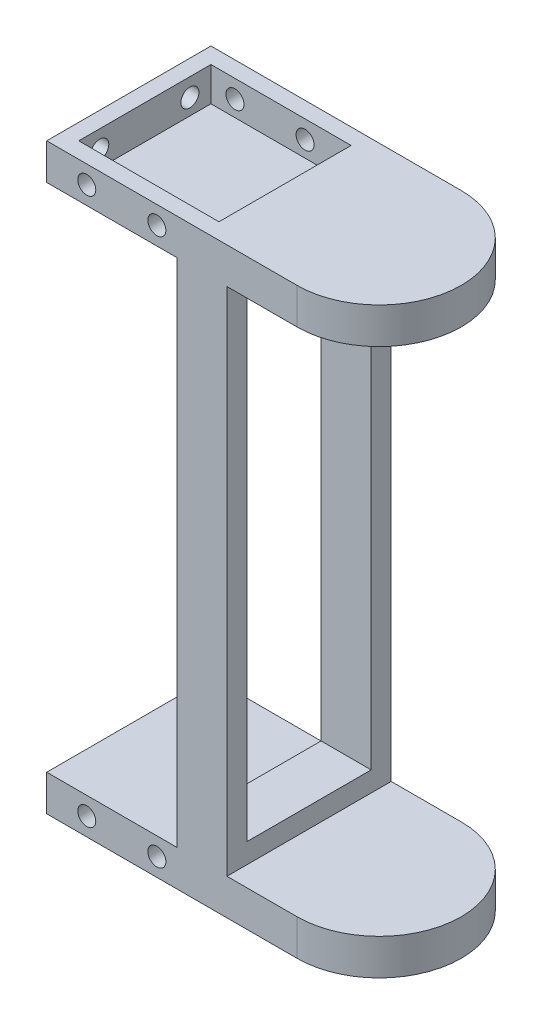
from build123d import *

# Parameters (mm, degrees)
LINEAR_AUSTRAGEN1_DEPTH         = 145.5
SKIZZE2_W                       = 76
SKIZZE2_H                       = 255
SKIZZE2_W_2                     = 65
SCHNITT_LINEAR_AUSTRAGEN1_DEPTH = 196.960455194
SKIZZE3_W                       = 70
SKIZZE3_H                       = 66
SCHNITT_LINEAR_AUSTRAGEN2_DEPTH = 17
SKIZZE4_R                       = 4.5
SCHNITT_LINEAR_AUSTRAGEN3_DEPTH = 196.960455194
SCHNITT_LINEAR_AUSTRAGEN4_REACH = 226.516
SKIZZE5_R                       = 4.5
SKIZZE6_W                       = 62
SKIZZE6_H                       = 235
SCHNITT_LINEAR_AUSTRAGEN5_DEPTH = 182.802777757


with BuildPart() as part:
    # Skizze1 → Linear austragen1 (new, symmetric)
    with BuildSketch(Plane(origin=(0, 0, 0), x_dir=(1, 0, 0), z_dir=(0, 1, 0))):
        with BuildLine():
            Line((-63.5, 41), (61.5, 41))
            ThreePointArc((61.5, 41), (102.5, 0), (61.5, -41))
            Line((61.5, -41), (-63.5, -41))
            Line((-63.5, -41), (-63.5, 41))
        make_face()
    extrude(amount=LINEAR_AUSTRAGEN1_DEPTH, both=True)

    # Skizze2 → Schnitt-Linear austragen1 (cut, through all)
    with BuildSketch(Plane.XY.offset(41)):
        with Locations((64.5, 0)):
            Rectangle(SKIZZE2_W, SKIZZE2_H)
        with Locations((-31, 0)):
            Rectangle(SKIZZE2_W_2, SKIZZE2_H)
    extrude(amount=-SCHNITT_LINEAR_AUSTRAGEN1_DEPTH, mode=Mode.SUBTRACT)

    # Skizze3 → Schnitt-Linear austragen2 (cut)
    with BuildSketch(Plane.XZ.offset(145.5)):
        with Locations((-20.5, 0)):
            Rectangle(SKIZZE3_W, SKIZZE3_H)
    schnitt_linear_austragen2 = extrude(amount=-SCHNITT_LINEAR_AUSTRAGEN2_DEPTH, mode=Mode.SUBTRACT)

    # Spiegeln1: Schnitt-Linear austragen2 across plane
    add(schnitt_linear_austragen2.mirror(Plane.ZX), mode=Mode.SUBTRACT)

    # Skizze4 → Schnitt-Linear austragen3 (cut, through all)
    with BuildSketch(Plane.XY.offset(41)):
        with Locations((-43.5, 136.5)):
            Circle(SKIZZE4_R)
        with Locations((-8.5, 136.5)):
            Circle(SKIZZE4_R)
        with Locations(Location((-8.5, -136.5, 0), (0, 0, 180))):
            Circle(SKIZZE4_R)
        with Locations(Location((-43.5, -136.5, 0), (0, 0, 180))):
            Circle(SKIZZE4_R)
    extrude(amount=-SCHNITT_LINEAR_AUSTRAGEN3_DEPTH, mode=Mode.SUBTRACT)

    # Skizze5 → Schnitt-Linear austragen4 (cut, up to next)
    with BuildSketch(Plane.ZY.offset(63.5), mode=Mode.PRIVATE) as schnitt_linear_austragen4_sk1:
        with Locations((-22.5, 136.5)):
            Circle(SKIZZE5_R)
    schnitt_linear_austragen4_tool1 = extrude(schnitt_linear_austragen4_sk1.sketch, amount=-SCHNITT_LINEAR_AUSTRAGEN4_REACH, mode=Mode.PRIVATE) & part.part
    # Skizze5 → Schnitt-Linear austragen4 (cut, up to next)
    with BuildSketch(Plane.ZY.offset(63.5), mode=Mode.PRIVATE) as schnitt_linear_austragen4_sk2:
        with Locations((22.5, 136.5)):
            Circle(SKIZZE5_R)
    schnitt_linear_austragen4_tool2 = extrude(schnitt_linear_austragen4_sk2.sketch, amount=-SCHNITT_LINEAR_AUSTRAGEN4_REACH, mode=Mode.PRIVATE) & part.part
    # Skizze5 → Schnitt-Linear austragen4 (cut, up to next)
    with BuildSketch(Plane.ZY.offset(63.5), mode=Mode.PRIVATE) as schnitt_linear_austragen4_sk3:
        with Locations((22.5, -136.5)):
            Circle(SKIZZE5_R)
    schnitt_linear_austragen4_tool3 = extrude(schnitt_linear_austragen4_sk3.sketch, amount=-SCHNITT_LINEAR_AUSTRAGEN4_REACH, mode=Mode.PRIVATE) & part.part
    # Skizze5 → Schnitt-Linear austragen4 (cut, up to next)
    with BuildSketch(Plane.ZY.offset(63.5), mode=Mode.PRIVATE) as schnitt_linear_austragen4_sk4:
        with Locations((-22.5, -136.5)):
            Circle(SKIZZE5_R)
    schnitt_linear_austragen4_tool4 = extrude(schnitt_linear_austragen4_sk4.sketch, amount=-SCHNITT_LINEAR_AUSTRAGEN4_REACH, mode=Mode.PRIVATE) & part.part
    add(schnitt_linear_austragen4_tool1.solids().sort_by_distance((-63.5, 136.5, -22.5))[0], mode=Mode.SUBTRACT)
    add(schnitt_linear_austragen4_tool2.solids().sort_by_distance((-63.5, 136.5, 22.5))[0], mode=Mode.SUBTRACT)
    add(schnitt_linear_austragen4_tool3.solids().sort_by_distance((-63.5, -136.5, 22.5))[0], mode=Mode.SUBTRACT)
    add(schnitt_linear_austragen4_tool4.solids().sort_by_distance((-63.5, -136.5, -22.5))[0], mode=Mode.SUBTRACT)

    # Skizze6 → Schnitt-Linear austragen5 (cut, through all)
    with BuildSketch(Plane.ZY.offset(-1.5)):
        Rectangle(SKIZZE6_W, SKIZZE6_H)
    extrude(amount=-SCHNITT_LINEAR_AUSTRAGEN5_DEPTH, mode=Mode.SUBTRACT)


solid = part.part
